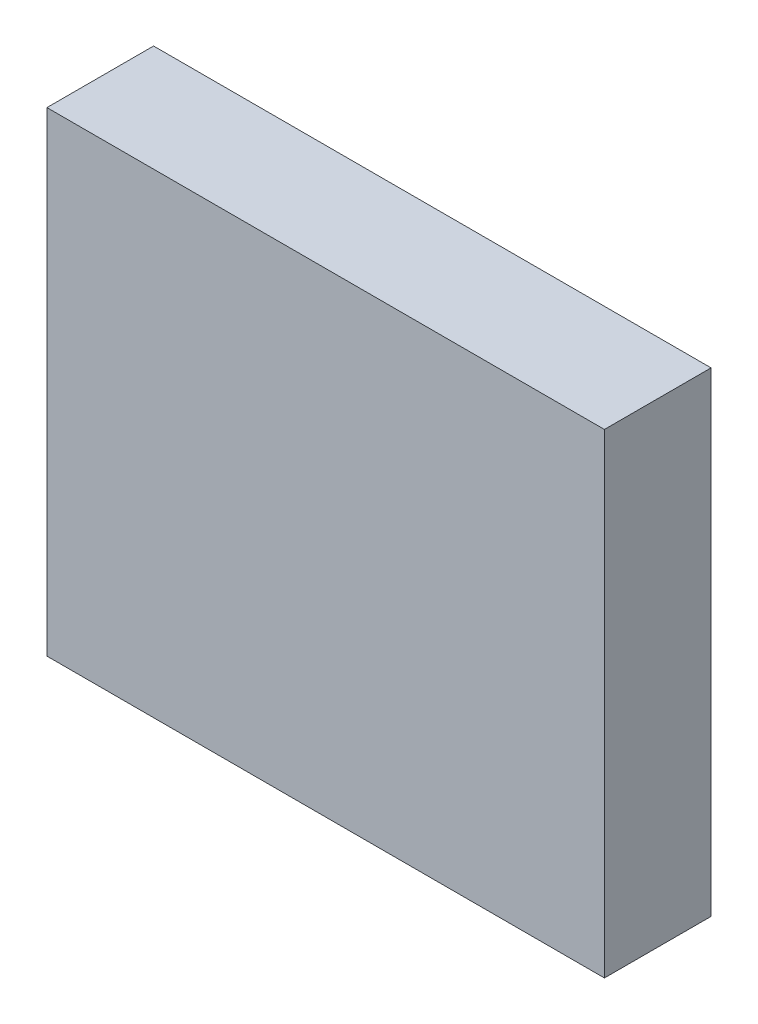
ISO-10303-21;
HEADER;
FILE_DESCRIPTION(('STEP AP214'),'2;1');
FILE_NAME('part.step','',(''),(''),'','','');
FILE_SCHEMA(('AUTOMOTIVE_DESIGN { 1 0 10303 214 1 1 1 1 }'));
ENDSEC;
DATA;
#1=APPLICATION_CONTEXT('core data for automotive mechanical design processes');
#2=APPLICATION_PROTOCOL_DEFINITION('international standard','automotive_design',2000,#1);
#3=PRODUCT_CONTEXT('',#1,'mechanical');
#4=PRODUCT('Part','Part','',(#3));
#5=PRODUCT_RELATED_PRODUCT_CATEGORY('part','',(#4));
#6=PRODUCT_DEFINITION_FORMATION('','',#4);
#7=PRODUCT_DEFINITION_CONTEXT('part definition',#1,'design');
#8=PRODUCT_DEFINITION('design','',#6,#7);
#9=PRODUCT_DEFINITION_SHAPE('','',#8);
#10=(LENGTH_UNIT() NAMED_UNIT(*) SI_UNIT(.MILLI.,.METRE.));
#11=(NAMED_UNIT(*) PLANE_ANGLE_UNIT() SI_UNIT($,.RADIAN.));
#12=(NAMED_UNIT(*) SI_UNIT($,.STERADIAN.) SOLID_ANGLE_UNIT());
#13=UNCERTAINTY_MEASURE_WITH_UNIT(LENGTH_MEASURE(1.E-05),#10,'distance_accuracy_value','');
#14=(GEOMETRIC_REPRESENTATION_CONTEXT(3) GLOBAL_UNCERTAINTY_ASSIGNED_CONTEXT((#13)) GLOBAL_UNIT_ASSIGNED_CONTEXT((#10,
#11,#12)) REPRESENTATION_CONTEXT('',''));
#15=CARTESIAN_POINT('',(0.,0.,0.));
#16=DIRECTION('',(0.,0.,1.));
#17=DIRECTION('',(1.,0.,0.));
#18=AXIS2_PLACEMENT_3D('',#15,#16,#17);
#19=CARTESIAN_POINT('',(2.87500102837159,-2.44999967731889,0.));
#20=DIRECTION('',(1.74845553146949E-07,-0.999999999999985,0.));
#21=DIRECTION('',(-0.999999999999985,-1.74845553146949E-07,0.));
#22=AXIS2_PLACEMENT_3D('',#19,#20,#21);
#23=PLANE('',#22);
#24=DIRECTION('',(0.,0.,1.));
#25=VECTOR('',#24,1.);
#26=CARTESIAN_POINT('',(2.87500102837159,-2.44999967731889,0.));
#27=LINE('',#26,#25);
#28=CARTESIAN_POINT('',(2.87500102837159,-2.44999967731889,0.));
#29=VERTEX_POINT('',#28);
#30=CARTESIAN_POINT('',(2.87500102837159,-2.44999967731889,1.10000034));
#31=VERTEX_POINT('',#30);
#32=EDGE_CURVE('E11',#29,#31,#27,.T.);
#33=ORIENTED_EDGE('',*,*,#32,.T.);
#34=DIRECTION('',(-0.999999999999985,-1.74845553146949E-07,0.));
#35=VECTOR('',#34,1.);
#36=CARTESIAN_POINT('',(2.87500102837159,-2.44999967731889,1.10000034));
#37=LINE('',#36,#35);
#38=CARTESIAN_POINT('',(-2.87500017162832,-2.45000068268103,1.10000034));
#39=VERTEX_POINT('',#38);
#40=EDGE_CURVE('E24',#31,#39,#37,.T.);
#41=ORIENTED_EDGE('',*,*,#40,.T.);
#42=DIRECTION('',(0.,0.,1.));
#43=VECTOR('',#42,1.);
#44=CARTESIAN_POINT('',(-2.87500017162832,-2.45000068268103,0.));
#45=LINE('',#44,#43);
#46=CARTESIAN_POINT('',(-2.87500017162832,-2.45000068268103,0.));
#47=VERTEX_POINT('',#46);
#48=EDGE_CURVE('E84',#47,#39,#45,.T.);
#49=ORIENTED_EDGE('',*,*,#48,.F.);
#50=DIRECTION('',(-0.999999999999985,-1.74845553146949E-07,0.));
#51=VECTOR('',#50,1.);
#52=CARTESIAN_POINT('',(2.87500102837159,-2.44999967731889,0.));
#53=LINE('',#52,#51);
#54=EDGE_CURVE('E82',#29,#47,#53,.T.);
#55=ORIENTED_EDGE('',*,*,#54,.F.);
#56=EDGE_LOOP('',(#33,#41,#49,#55));
#57=FACE_BOUND('',#56,.T.);
#58=ADVANCED_FACE('F17',(#57),#23,.T.);
#59=CARTESIAN_POINT('',(-2.87500017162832,-2.45000068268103,0.));
#60=DIRECTION('',(-0.999999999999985,-1.74845553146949E-07,0.));
#61=DIRECTION('',(-1.74845553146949E-07,0.999999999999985,0.));
#62=AXIS2_PLACEMENT_3D('',#59,#60,#61);
#63=PLANE('',#62);
#64=ORIENTED_EDGE('',*,*,#48,.T.);
#65=DIRECTION('',(-1.74845553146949E-07,0.999999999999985,0.));
#66=VECTOR('',#65,1.);
#67=CARTESIAN_POINT('',(-2.87500017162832,-2.45000068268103,1.10000034));
#68=LINE('',#67,#66);
#69=CARTESIAN_POINT('',(-2.87500102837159,2.44999967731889,1.10000034));
#70=VERTEX_POINT('',#69);
#71=EDGE_CURVE('E80',#39,#70,#68,.T.);
#72=ORIENTED_EDGE('',*,*,#71,.T.);
#73=DIRECTION('',(0.,0.,1.));
#74=VECTOR('',#73,1.);
#75=CARTESIAN_POINT('',(-2.87500102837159,2.44999967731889,0.));
#76=LINE('',#75,#74);
#77=CARTESIAN_POINT('',(-2.87500102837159,2.44999967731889,0.));
#78=VERTEX_POINT('',#77);
#79=EDGE_CURVE('E78',#78,#70,#76,.T.);
#80=ORIENTED_EDGE('',*,*,#79,.F.);
#81=DIRECTION('',(-1.74845553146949E-07,0.999999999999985,0.));
#82=VECTOR('',#81,1.);
#83=CARTESIAN_POINT('',(-2.87500017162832,-2.45000068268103,0.));
#84=LINE('',#83,#82);
#85=EDGE_CURVE('E68',#47,#78,#84,.T.);
#86=ORIENTED_EDGE('',*,*,#85,.F.);
#87=EDGE_LOOP('',(#64,#72,#80,#86));
#88=FACE_BOUND('',#87,.T.);
#89=ADVANCED_FACE('F90',(#88),#63,.T.);
#90=CARTESIAN_POINT('',(-2.87500102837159,2.44999967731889,0.));
#91=DIRECTION('',(-1.74845553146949E-07,0.999999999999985,0.));
#92=DIRECTION('',(0.999999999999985,1.74845553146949E-07,0.));
#93=AXIS2_PLACEMENT_3D('',#90,#91,#92);
#94=PLANE('',#93);
#95=ORIENTED_EDGE('',*,*,#79,.T.);
#96=DIRECTION('',(0.999999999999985,1.74845553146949E-07,0.));
#97=VECTOR('',#96,1.);
#98=CARTESIAN_POINT('',(-2.87500102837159,2.44999967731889,1.10000034));
#99=LINE('',#98,#97);
#100=CARTESIAN_POINT('',(2.87500017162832,2.45000068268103,1.10000034));
#101=VERTEX_POINT('',#100);
#102=EDGE_CURVE('E60',#70,#101,#99,.T.);
#103=ORIENTED_EDGE('',*,*,#102,.T.);
#104=DIRECTION('',(0.,0.,1.));
#105=VECTOR('',#104,1.);
#106=CARTESIAN_POINT('',(2.87500017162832,2.45000068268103,0.));
#107=LINE('',#106,#105);
#108=CARTESIAN_POINT('',(2.87500017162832,2.45000068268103,0.));
#109=VERTEX_POINT('',#108);
#110=EDGE_CURVE('E54',#109,#101,#107,.T.);
#111=ORIENTED_EDGE('',*,*,#110,.F.);
#112=DIRECTION('',(0.999999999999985,1.74845553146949E-07,0.));
#113=VECTOR('',#112,1.);
#114=CARTESIAN_POINT('',(-2.87500102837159,2.44999967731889,0.));
#115=LINE('',#114,#113);
#116=EDGE_CURVE('E58',#78,#109,#115,.T.);
#117=ORIENTED_EDGE('',*,*,#116,.F.);
#118=EDGE_LOOP('',(#95,#103,#111,#117));
#119=FACE_BOUND('',#118,.T.);
#120=ADVANCED_FACE('F57',(#119),#94,.T.);
#121=CARTESIAN_POINT('',(2.87500017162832,2.45000068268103,0.));
#122=DIRECTION('',(0.999999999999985,1.74845553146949E-07,0.));
#123=DIRECTION('',(1.74845553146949E-07,-0.999999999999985,0.));
#124=AXIS2_PLACEMENT_3D('',#121,#122,#123);
#125=PLANE('',#124);
#126=ORIENTED_EDGE('',*,*,#110,.T.);
#127=DIRECTION('',(1.74845553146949E-07,-0.999999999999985,0.));
#128=VECTOR('',#127,1.);
#129=CARTESIAN_POINT('',(2.87500017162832,2.45000068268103,1.10000034));
#130=LINE('',#129,#128);
#131=EDGE_CURVE('E70',#101,#31,#130,.T.);
#132=ORIENTED_EDGE('',*,*,#131,.T.);
#133=ORIENTED_EDGE('',*,*,#32,.F.);
#134=DIRECTION('',(1.74845553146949E-07,-0.999999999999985,0.));
#135=VECTOR('',#134,1.);
#136=CARTESIAN_POINT('',(2.87500017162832,2.45000068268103,0.));
#137=LINE('',#136,#135);
#138=EDGE_CURVE('E67',#109,#29,#137,.T.);
#139=ORIENTED_EDGE('',*,*,#138,.F.);
#140=EDGE_LOOP('',(#126,#132,#133,#139));
#141=FACE_BOUND('',#140,.T.);
#142=ADVANCED_FACE('F72',(#141),#125,.T.);
#143=CARTESIAN_POINT('',(2.87500102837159,-2.44999967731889,0.));
#144=DIRECTION('',(0.,0.,1.));
#145=DIRECTION('',(0.999999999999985,1.74845553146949E-07,0.));
#146=AXIS2_PLACEMENT_3D('',#143,#144,#145);
#147=PLANE('',#146);
#148=ORIENTED_EDGE('',*,*,#54,.T.);
#149=ORIENTED_EDGE('',*,*,#85,.T.);
#150=ORIENTED_EDGE('',*,*,#116,.T.);
#151=ORIENTED_EDGE('',*,*,#138,.T.);
#152=EDGE_LOOP('',(#148,#149,#150,#151));
#153=FACE_BOUND('',#152,.T.);
#154=ADVANCED_FACE('F66',(#153),#147,.F.);
#155=CARTESIAN_POINT('',(2.87500102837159,-2.44999967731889,1.10000034));
#156=DIRECTION('',(0.,0.,1.));
#157=DIRECTION('',(0.999999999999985,1.74845553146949E-07,0.));
#158=AXIS2_PLACEMENT_3D('',#155,#156,#157);
#159=PLANE('',#158);
#160=ORIENTED_EDGE('',*,*,#131,.F.);
#161=ORIENTED_EDGE('',*,*,#102,.F.);
#162=ORIENTED_EDGE('',*,*,#71,.F.);
#163=ORIENTED_EDGE('',*,*,#40,.F.);
#164=EDGE_LOOP('',(#160,#161,#162,#163));
#165=FACE_BOUND('',#164,.T.);
#166=ADVANCED_FACE('F91',(#165),#159,.T.);
#167=CLOSED_SHELL('',(#58,#89,#120,#142,#154,#166));
#168=MANIFOLD_SOLID_BREP('B1',#167);
#169=ADVANCED_BREP_SHAPE_REPRESENTATION('',(#18,#168),#14);
#170=SHAPE_DEFINITION_REPRESENTATION(#9,#169);
ENDSEC;
END-ISO-10303-21;
